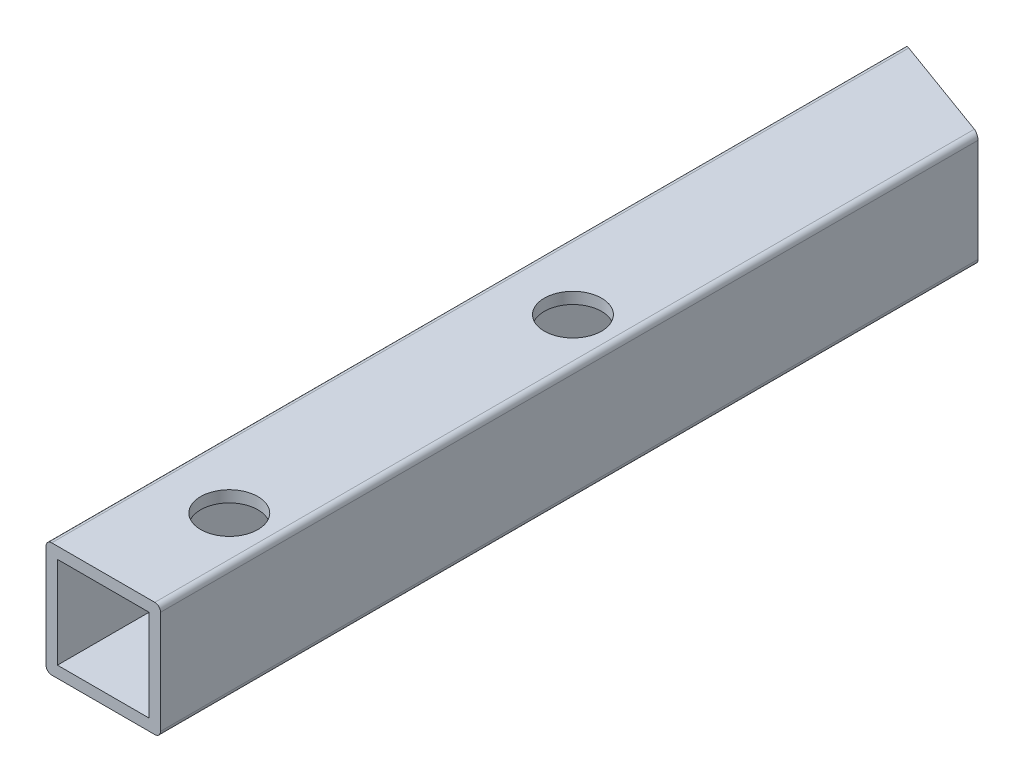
ISO-10303-21;
HEADER;
FILE_DESCRIPTION(('STEP AP214'),'2;1');
FILE_NAME('part.step','',(''),(''),'','','');
FILE_SCHEMA(('AUTOMOTIVE_DESIGN { 1 0 10303 214 1 1 1 1 }'));
ENDSEC;
DATA;
#1=APPLICATION_CONTEXT('core data for automotive mechanical design processes');
#2=APPLICATION_PROTOCOL_DEFINITION('international standard','automotive_design',2000,#1);
#3=PRODUCT_CONTEXT('',#1,'mechanical');
#4=PRODUCT('Part','Part','',(#3));
#5=PRODUCT_RELATED_PRODUCT_CATEGORY('part','',(#4));
#6=PRODUCT_DEFINITION_FORMATION('','',#4);
#7=PRODUCT_DEFINITION_CONTEXT('part definition',#1,'design');
#8=PRODUCT_DEFINITION('design','',#6,#7);
#9=PRODUCT_DEFINITION_SHAPE('','',#8);
#10=(LENGTH_UNIT() NAMED_UNIT(*) SI_UNIT(.MILLI.,.METRE.));
#11=(NAMED_UNIT(*) PLANE_ANGLE_UNIT() SI_UNIT($,.RADIAN.));
#12=(NAMED_UNIT(*) SI_UNIT($,.STERADIAN.) SOLID_ANGLE_UNIT());
#13=UNCERTAINTY_MEASURE_WITH_UNIT(LENGTH_MEASURE(1.E-05),#10,'distance_accuracy_value','');
#14=(GEOMETRIC_REPRESENTATION_CONTEXT(3) GLOBAL_UNCERTAINTY_ASSIGNED_CONTEXT((#13)) GLOBAL_UNIT_ASSIGNED_CONTEXT((#10,
#11,#12)) REPRESENTATION_CONTEXT('',''));
#15=CARTESIAN_POINT('',(0.,0.,0.));
#16=DIRECTION('',(0.,0.,1.));
#17=DIRECTION('',(1.,0.,0.));
#18=AXIS2_PLACEMENT_3D('',#15,#16,#17);
#19=CARTESIAN_POINT('',(-9.,-9.,150.));
#20=DIRECTION('',(0.,0.,-1.));
#21=DIRECTION('',(-1.,0.,0.));
#22=AXIS2_PLACEMENT_3D('',#19,#20,#21);
#23=CYLINDRICAL_SURFACE('',#22,0.999999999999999);
#24=DIRECTION('',(0.,0.,-1.));
#25=VECTOR('',#24,1.);
#26=CARTESIAN_POINT('',(-10.,-9.,150.));
#27=LINE('',#26,#25);
#28=CARTESIAN_POINT('',(-10.,-9.,150.));
#29=VERTEX_POINT('',#28);
#30=CARTESIAN_POINT('',(-10.,-9.,0.));
#31=VERTEX_POINT('',#30);
#32=EDGE_CURVE('E169',#29,#31,#27,.T.);
#33=ORIENTED_EDGE('',*,*,#32,.T.);
#34=CARTESIAN_POINT('',(-9.,-9.,0.363970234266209));
#35=DIRECTION('',(0.34202014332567,0.,-0.939692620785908));
#36=DIRECTION('',(-0.939692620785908,0.,-0.34202014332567));
#37=AXIS2_PLACEMENT_3D('',#34,#35,#36);
#38=ELLIPSE('',#37,1.06417777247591,0.999999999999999);
#39=CARTESIAN_POINT('',(-8.99999999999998,-10.,0.363970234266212));
#40=VERTEX_POINT('',#39);
#41=EDGE_CURVE('E231',#31,#40,#38,.F.);
#42=ORIENTED_EDGE('',*,*,#41,.T.);
#43=DIRECTION('',(0.,0.,-1.));
#44=VECTOR('',#43,1.);
#45=CARTESIAN_POINT('',(-9.,-10.,150.));
#46=LINE('',#45,#44);
#47=CARTESIAN_POINT('',(-9.,-10.,150.));
#48=VERTEX_POINT('',#47);
#49=EDGE_CURVE('E40',#48,#40,#46,.T.);
#50=ORIENTED_EDGE('',*,*,#49,.F.);
#51=CARTESIAN_POINT('',(-9.,-9.,150.));
#52=DIRECTION('',(0.,0.,-1.));
#53=DIRECTION('',(-1.,0.,0.));
#54=AXIS2_PLACEMENT_3D('',#51,#52,#53);
#55=CIRCLE('',#54,0.999999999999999);
#56=EDGE_CURVE('E148',#48,#29,#55,.T.);
#57=ORIENTED_EDGE('',*,*,#56,.T.);
#58=EDGE_LOOP('',(#33,#42,#50,#57));
#59=FACE_BOUND('',#58,.T.);
#60=ADVANCED_FACE('F32',(#59),#23,.T.);
#61=CARTESIAN_POINT('',(9.,-10.,150.));
#62=DIRECTION('',(0.,-1.,0.));
#63=DIRECTION('',(0.,0.,-1.));
#64=AXIS2_PLACEMENT_3D('',#61,#62,#63);
#65=PLANE('',#64);
#66=CARTESIAN_POINT('',(2.,-10.,130.));
#67=DIRECTION('',(0.,-1.,0.));
#68=DIRECTION('',(0.,0.,-1.));
#69=AXIS2_PLACEMENT_3D('',#66,#67,#68);
#70=CIRCLE('',#69,5.);
#71=CARTESIAN_POINT('',(2.,-10.,135.));
#72=VERTEX_POINT('',#71);
#73=EDGE_CURVE('E203',#72,#72,#70,.T.);
#74=ORIENTED_EDGE('',*,*,#73,.F.);
#75=EDGE_LOOP('',(#74));
#76=FACE_BOUND('',#75,.T.);
#77=CARTESIAN_POINT('',(2.,-10.,70.));
#78=DIRECTION('',(0.,-1.,0.));
#79=DIRECTION('',(0.,0.,-1.));
#80=AXIS2_PLACEMENT_3D('',#77,#78,#79);
#81=CIRCLE('',#80,5.);
#82=CARTESIAN_POINT('',(2.,-10.,75.));
#83=VERTEX_POINT('',#82);
#84=EDGE_CURVE('E200',#83,#83,#81,.T.);
#85=ORIENTED_EDGE('',*,*,#84,.F.);
#86=EDGE_LOOP('',(#85));
#87=FACE_BOUND('',#86,.T.);
#88=ORIENTED_EDGE('',*,*,#49,.T.);
#89=DIRECTION('',(0.939692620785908,0.,0.34202014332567));
#90=VECTOR('',#89,1.);
#91=CARTESIAN_POINT('',(54.9864929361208,-10.,23.6531490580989));
#92=LINE('',#91,#90);
#93=CARTESIAN_POINT('',(9.,-10.,6.91543445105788));
#94=VERTEX_POINT('',#93);
#95=EDGE_CURVE('E228',#40,#94,#92,.T.);
#96=ORIENTED_EDGE('',*,*,#95,.T.);
#97=DIRECTION('',(0.,0.,-1.));
#98=VECTOR('',#97,1.);
#99=CARTESIAN_POINT('',(9.,-10.,150.));
#100=LINE('',#99,#98);
#101=CARTESIAN_POINT('',(9.,-10.,150.));
#102=VERTEX_POINT('',#101);
#103=EDGE_CURVE('E174',#102,#94,#100,.T.);
#104=ORIENTED_EDGE('',*,*,#103,.F.);
#105=DIRECTION('',(-1.,0.,0.));
#106=VECTOR('',#105,1.);
#107=CARTESIAN_POINT('',(9.,-10.,150.));
#108=LINE('',#107,#106);
#109=EDGE_CURVE('E166',#102,#48,#108,.T.);
#110=ORIENTED_EDGE('',*,*,#109,.T.);
#111=EDGE_LOOP('',(#88,#96,#104,#110));
#112=FACE_BOUND('',#111,.T.);
#113=ADVANCED_FACE('F259',(#76,#87,#112),#65,.T.);
#114=CARTESIAN_POINT('',(9.,-9.,150.));
#115=DIRECTION('',(0.,0.,-1.));
#116=DIRECTION('',(-1.,0.,0.));
#117=AXIS2_PLACEMENT_3D('',#114,#115,#116);
#118=CYLINDRICAL_SURFACE('',#117,1.);
#119=ORIENTED_EDGE('',*,*,#103,.T.);
#120=CARTESIAN_POINT('',(9.,-9.,6.91543445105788));
#121=DIRECTION('',(0.34202014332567,0.,-0.939692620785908));
#122=DIRECTION('',(-0.939692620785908,0.,-0.34202014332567));
#123=AXIS2_PLACEMENT_3D('',#120,#121,#122);
#124=ELLIPSE('',#123,1.06417777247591,1.);
#125=CARTESIAN_POINT('',(10.,-9.,7.27940468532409));
#126=VERTEX_POINT('',#125);
#127=EDGE_CURVE('E225',#94,#126,#124,.F.);
#128=ORIENTED_EDGE('',*,*,#127,.T.);
#129=DIRECTION('',(0.,0.,-1.));
#130=VECTOR('',#129,1.);
#131=CARTESIAN_POINT('',(10.,-9.,150.));
#132=LINE('',#131,#130);
#133=CARTESIAN_POINT('',(10.,-9.,150.));
#134=VERTEX_POINT('',#133);
#135=EDGE_CURVE('E177',#134,#126,#132,.T.);
#136=ORIENTED_EDGE('',*,*,#135,.F.);
#137=CARTESIAN_POINT('',(9.,-9.,150.));
#138=DIRECTION('',(0.,0.,-1.));
#139=DIRECTION('',(-1.,0.,0.));
#140=AXIS2_PLACEMENT_3D('',#137,#138,#139);
#141=CIRCLE('',#140,1.);
#142=EDGE_CURVE('E163',#134,#102,#141,.T.);
#143=ORIENTED_EDGE('',*,*,#142,.T.);
#144=EDGE_LOOP('',(#119,#128,#136,#143));
#145=FACE_BOUND('',#144,.T.);
#146=ADVANCED_FACE('F264',(#145),#118,.T.);
#147=CARTESIAN_POINT('',(10.,-9.,150.));
#148=DIRECTION('',(-1.,0.,0.));
#149=DIRECTION('',(0.,-1.,0.));
#150=AXIS2_PLACEMENT_3D('',#147,#148,#149);
#151=PLANE('',#150);
#152=DIRECTION('',(0.,-1.,0.));
#153=VECTOR('',#152,1.);
#154=CARTESIAN_POINT('',(10.,-9.00000000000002,7.27940468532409));
#155=LINE('',#154,#153);
#156=CARTESIAN_POINT('',(10.,9.00000000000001,7.27940468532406));
#157=VERTEX_POINT('',#156);
#158=EDGE_CURVE('E223',#157,#126,#155,.T.);
#159=ORIENTED_EDGE('',*,*,#158,.F.);
#160=DIRECTION('',(0.,0.,-1.));
#161=VECTOR('',#160,1.);
#162=CARTESIAN_POINT('',(10.,9.00000000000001,150.));
#163=LINE('',#162,#161);
#164=CARTESIAN_POINT('',(10.,9.00000000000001,150.));
#165=VERTEX_POINT('',#164);
#166=EDGE_CURVE('E180',#165,#157,#163,.T.);
#167=ORIENTED_EDGE('',*,*,#166,.F.);
#168=DIRECTION('',(0.,1.,0.));
#169=VECTOR('',#168,1.);
#170=CARTESIAN_POINT('',(10.,-9.,150.));
#171=LINE('',#170,#169);
#172=EDGE_CURVE('E161',#134,#165,#171,.T.);
#173=ORIENTED_EDGE('',*,*,#172,.F.);
#174=ORIENTED_EDGE('',*,*,#135,.T.);
#175=EDGE_LOOP('',(#159,#167,#173,#174));
#176=FACE_BOUND('',#175,.T.);
#177=ADVANCED_FACE('F289',(#176),#151,.F.);
#178=CARTESIAN_POINT('',(9.,9.,150.));
#179=DIRECTION('',(0.,0.,-1.));
#180=DIRECTION('',(-1.,0.,0.));
#181=AXIS2_PLACEMENT_3D('',#178,#179,#180);
#182=CYLINDRICAL_SURFACE('',#181,0.999999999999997);
#183=CARTESIAN_POINT('',(9.,9.,6.91543445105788));
#184=DIRECTION('',(0.34202014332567,0.,-0.939692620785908));
#185=DIRECTION('',(-0.939692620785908,0.,-0.34202014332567));
#186=AXIS2_PLACEMENT_3D('',#183,#184,#185);
#187=ELLIPSE('',#186,1.06417777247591,0.999999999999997);
#188=CARTESIAN_POINT('',(9.00000000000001,10.,6.91543445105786));
#189=VERTEX_POINT('',#188);
#190=EDGE_CURVE('E221',#189,#157,#187,.T.);
#191=ORIENTED_EDGE('',*,*,#190,.F.);
#192=DIRECTION('',(0.,0.,-1.));
#193=VECTOR('',#192,1.);
#194=CARTESIAN_POINT('',(9.,10.,150.));
#195=LINE('',#194,#193);
#196=CARTESIAN_POINT('',(9.,10.,150.));
#197=VERTEX_POINT('',#196);
#198=EDGE_CURVE('E183',#197,#189,#195,.T.);
#199=ORIENTED_EDGE('',*,*,#198,.F.);
#200=CARTESIAN_POINT('',(9.,9.,150.));
#201=DIRECTION('',(0.,0.,1.));
#202=DIRECTION('',(1.,0.,0.));
#203=AXIS2_PLACEMENT_3D('',#200,#201,#202);
#204=CIRCLE('',#203,0.999999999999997);
#205=EDGE_CURVE('E159',#165,#197,#204,.T.);
#206=ORIENTED_EDGE('',*,*,#205,.F.);
#207=ORIENTED_EDGE('',*,*,#166,.T.);
#208=EDGE_LOOP('',(#191,#199,#206,#207));
#209=FACE_BOUND('',#208,.T.);
#210=ADVANCED_FACE('F286',(#209),#182,.T.);
#211=CARTESIAN_POINT('',(-9.,10.,150.));
#212=DIRECTION('',(0.,1.,0.));
#213=DIRECTION('',(0.,0.,1.));
#214=AXIS2_PLACEMENT_3D('',#211,#212,#213);
#215=PLANE('',#214);
#216=CARTESIAN_POINT('',(2.,10.,130.));
#217=DIRECTION('',(0.,1.,0.));
#218=DIRECTION('',(0.,0.,1.));
#219=AXIS2_PLACEMENT_3D('',#216,#217,#218);
#220=CIRCLE('',#219,5.);
#221=CARTESIAN_POINT('',(2.,10.,135.));
#222=VERTEX_POINT('',#221);
#223=EDGE_CURVE('E338',#222,#222,#220,.T.);
#224=ORIENTED_EDGE('',*,*,#223,.F.);
#225=EDGE_LOOP('',(#224));
#226=FACE_BOUND('',#225,.T.);
#227=CARTESIAN_POINT('',(2.,10.,70.));
#228=DIRECTION('',(0.,1.,0.));
#229=DIRECTION('',(0.,0.,1.));
#230=AXIS2_PLACEMENT_3D('',#227,#228,#229);
#231=CIRCLE('',#230,5.);
#232=CARTESIAN_POINT('',(2.,10.,75.));
#233=VERTEX_POINT('',#232);
#234=EDGE_CURVE('E196',#233,#233,#231,.T.);
#235=ORIENTED_EDGE('',*,*,#234,.F.);
#236=EDGE_LOOP('',(#235));
#237=FACE_BOUND('',#236,.T.);
#238=ORIENTED_EDGE('',*,*,#198,.T.);
#239=DIRECTION('',(-0.939692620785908,0.,-0.34202014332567));
#240=VECTOR('',#239,1.);
#241=CARTESIAN_POINT('',(39.09209294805,10.,17.86806057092));
#242=LINE('',#241,#240);
#243=CARTESIAN_POINT('',(-9.,10.,0.363970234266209));
#244=VERTEX_POINT('',#243);
#245=EDGE_CURVE('E218',#189,#244,#242,.T.);
#246=ORIENTED_EDGE('',*,*,#245,.T.);
#247=DIRECTION('',(0.,0.,-1.));
#248=VECTOR('',#247,1.);
#249=CARTESIAN_POINT('',(-9.,10.,150.));
#250=LINE('',#249,#248);
#251=CARTESIAN_POINT('',(-9.,10.,150.));
#252=VERTEX_POINT('',#251);
#253=EDGE_CURVE('E186',#252,#244,#250,.T.);
#254=ORIENTED_EDGE('',*,*,#253,.F.);
#255=DIRECTION('',(1.,0.,0.));
#256=VECTOR('',#255,1.);
#257=CARTESIAN_POINT('',(-9.,10.,150.));
#258=LINE('',#257,#256);
#259=EDGE_CURVE('E156',#252,#197,#258,.T.);
#260=ORIENTED_EDGE('',*,*,#259,.T.);
#261=EDGE_LOOP('',(#238,#246,#254,#260));
#262=FACE_BOUND('',#261,.T.);
#263=ADVANCED_FACE('F277',(#226,#237,#262),#215,.T.);
#264=CARTESIAN_POINT('',(-9.,9.,150.));
#265=DIRECTION('',(0.,0.,-1.));
#266=DIRECTION('',(-1.,0.,0.));
#267=AXIS2_PLACEMENT_3D('',#264,#265,#266);
#268=CYLINDRICAL_SURFACE('',#267,0.999999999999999);
#269=ORIENTED_EDGE('',*,*,#253,.T.);
#270=CARTESIAN_POINT('',(-9.,9.,0.363970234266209));
#271=DIRECTION('',(0.34202014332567,0.,-0.939692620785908));
#272=DIRECTION('',(-0.939692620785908,0.,-0.34202014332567));
#273=AXIS2_PLACEMENT_3D('',#270,#271,#272);
#274=ELLIPSE('',#273,1.06417777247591,0.999999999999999);
#275=CARTESIAN_POINT('',(-10.,9.,0.));
#276=VERTEX_POINT('',#275);
#277=EDGE_CURVE('E130',#244,#276,#274,.F.);
#278=ORIENTED_EDGE('',*,*,#277,.T.);
#279=DIRECTION('',(0.,0.,-1.));
#280=VECTOR('',#279,1.);
#281=CARTESIAN_POINT('',(-10.,9.,150.));
#282=LINE('',#281,#280);
#283=CARTESIAN_POINT('',(-10.,9.,150.));
#284=VERTEX_POINT('',#283);
#285=EDGE_CURVE('E189',#284,#276,#282,.T.);
#286=ORIENTED_EDGE('',*,*,#285,.F.);
#287=CARTESIAN_POINT('',(-9.,9.,150.));
#288=DIRECTION('',(0.,0.,-1.));
#289=DIRECTION('',(-1.,0.,0.));
#290=AXIS2_PLACEMENT_3D('',#287,#288,#289);
#291=CIRCLE('',#290,0.999999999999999);
#292=EDGE_CURVE('E153',#284,#252,#291,.T.);
#293=ORIENTED_EDGE('',*,*,#292,.T.);
#294=EDGE_LOOP('',(#269,#278,#286,#293));
#295=FACE_BOUND('',#294,.T.);
#296=ADVANCED_FACE('F254',(#295),#268,.T.);
#297=CARTESIAN_POINT('',(-8.,-9.,150.));
#298=DIRECTION('',(1.,0.,0.));
#299=DIRECTION('',(0.,1.,0.));
#300=AXIS2_PLACEMENT_3D('',#297,#298,#299);
#301=PLANE('',#300);
#302=DIRECTION('',(0.,0.,-1.));
#303=VECTOR('',#302,1.);
#304=CARTESIAN_POINT('',(-8.,-8.,150.));
#305=LINE('',#304,#303);
#306=CARTESIAN_POINT('',(-8.,-8.,150.));
#307=VERTEX_POINT('',#306);
#308=CARTESIAN_POINT('',(-8.,-8.,0.727940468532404));
#309=VERTEX_POINT('',#308);
#310=EDGE_CURVE('E129',#307,#309,#305,.T.);
#311=ORIENTED_EDGE('',*,*,#310,.T.);
#312=DIRECTION('',(0.,1.,0.));
#313=VECTOR('',#312,1.);
#314=CARTESIAN_POINT('',(-8.,-9.,0.727940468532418));
#315=LINE('',#314,#313);
#316=CARTESIAN_POINT('',(-7.99999999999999,8.,0.727940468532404));
#317=VERTEX_POINT('',#316);
#318=EDGE_CURVE('E121',#309,#317,#315,.T.);
#319=ORIENTED_EDGE('',*,*,#318,.T.);
#320=DIRECTION('',(0.,0.,-1.));
#321=VECTOR('',#320,1.);
#322=CARTESIAN_POINT('',(-8.,8.,150.));
#323=LINE('',#322,#321);
#324=CARTESIAN_POINT('',(-8.,8.,150.));
#325=VERTEX_POINT('',#324);
#326=EDGE_CURVE('E127',#325,#317,#323,.T.);
#327=ORIENTED_EDGE('',*,*,#326,.F.);
#328=DIRECTION('',(0.,-1.,0.));
#329=VECTOR('',#328,1.);
#330=CARTESIAN_POINT('',(-8.,-9.,150.));
#331=LINE('',#330,#329);
#332=EDGE_CURVE('E234',#325,#307,#331,.T.);
#333=ORIENTED_EDGE('',*,*,#332,.T.);
#334=EDGE_LOOP('',(#311,#319,#327,#333));
#335=FACE_BOUND('',#334,.T.);
#336=ADVANCED_FACE('F126',(#335),#301,.T.);
#337=CARTESIAN_POINT('',(-9.,-8.,150.));
#338=DIRECTION('',(0.,-1.,0.));
#339=DIRECTION('',(0.,0.,-1.));
#340=AXIS2_PLACEMENT_3D('',#337,#338,#339);
#341=PLANE('',#340);
#342=CARTESIAN_POINT('',(2.,-8.,130.));
#343=DIRECTION('',(0.,-1.,0.));
#344=DIRECTION('',(0.,0.,-1.));
#345=AXIS2_PLACEMENT_3D('',#342,#343,#344);
#346=CIRCLE('',#345,5.);
#347=CARTESIAN_POINT('',(2.,-8.,135.));
#348=VERTEX_POINT('',#347);
#349=EDGE_CURVE('E208',#348,#348,#346,.T.);
#350=ORIENTED_EDGE('',*,*,#349,.T.);
#351=EDGE_LOOP('',(#350));
#352=FACE_BOUND('',#351,.T.);
#353=CARTESIAN_POINT('',(2.,-8.,70.));
#354=DIRECTION('',(0.,-1.,0.));
#355=DIRECTION('',(0.,0.,-1.));
#356=AXIS2_PLACEMENT_3D('',#353,#354,#355);
#357=CIRCLE('',#356,5.);
#358=CARTESIAN_POINT('',(2.,-8.,75.));
#359=VERTEX_POINT('',#358);
#360=EDGE_CURVE('E195',#359,#359,#357,.T.);
#361=ORIENTED_EDGE('',*,*,#360,.T.);
#362=EDGE_LOOP('',(#361));
#363=FACE_BOUND('',#362,.T.);
#364=DIRECTION('',(0.939692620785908,0.,0.34202014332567));
#365=VECTOR('',#364,1.);
#366=CARTESIAN_POINT('',(39.09209294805,-8.,17.86806057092));
#367=LINE('',#366,#365);
#368=CARTESIAN_POINT('',(8.,-8.,6.5514642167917));
#369=VERTEX_POINT('',#368);
#370=EDGE_CURVE('E131',#309,#369,#367,.T.);
#371=ORIENTED_EDGE('',*,*,#370,.F.);
#372=ORIENTED_EDGE('',*,*,#310,.F.);
#373=DIRECTION('',(-1.,0.,0.));
#374=VECTOR('',#373,1.);
#375=CARTESIAN_POINT('',(-9.,-8.,150.));
#376=LINE('',#375,#374);
#377=CARTESIAN_POINT('',(8.,-8.,150.));
#378=VERTEX_POINT('',#377);
#379=EDGE_CURVE('E236',#378,#307,#376,.T.);
#380=ORIENTED_EDGE('',*,*,#379,.F.);
#381=DIRECTION('',(0.,0.,-1.));
#382=VECTOR('',#381,1.);
#383=CARTESIAN_POINT('',(8.,-8.,150.));
#384=LINE('',#383,#382);
#385=EDGE_CURVE('E138',#378,#369,#384,.T.);
#386=ORIENTED_EDGE('',*,*,#385,.T.);
#387=EDGE_LOOP('',(#371,#372,#380,#386));
#388=FACE_BOUND('',#387,.T.);
#389=ADVANCED_FACE('F245',(#352,#363,#388),#341,.F.);
#390=CARTESIAN_POINT('',(8.,-9.,150.));
#391=DIRECTION('',(-1.,0.,0.));
#392=DIRECTION('',(0.,-1.,0.));
#393=AXIS2_PLACEMENT_3D('',#390,#391,#392);
#394=PLANE('',#393);
#395=DIRECTION('',(0.,0.,-1.));
#396=VECTOR('',#395,1.);
#397=CARTESIAN_POINT('',(8.,8.,150.));
#398=LINE('',#397,#396);
#399=CARTESIAN_POINT('',(8.,8.,150.));
#400=VERTEX_POINT('',#399);
#401=CARTESIAN_POINT('',(8.,8.,6.55146421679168));
#402=VERTEX_POINT('',#401);
#403=EDGE_CURVE('E54',#400,#402,#398,.T.);
#404=ORIENTED_EDGE('',*,*,#403,.T.);
#405=DIRECTION('',(0.,-1.,0.));
#406=VECTOR('',#405,1.);
#407=CARTESIAN_POINT('',(8.,-9.00000000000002,6.5514642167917));
#408=LINE('',#407,#406);
#409=EDGE_CURVE('E47',#402,#369,#408,.T.);
#410=ORIENTED_EDGE('',*,*,#409,.T.);
#411=ORIENTED_EDGE('',*,*,#385,.F.);
#412=DIRECTION('',(0.,1.,0.));
#413=VECTOR('',#412,1.);
#414=CARTESIAN_POINT('',(8.,-9.,150.));
#415=LINE('',#414,#413);
#416=EDGE_CURVE('E140',#378,#400,#415,.T.);
#417=ORIENTED_EDGE('',*,*,#416,.T.);
#418=EDGE_LOOP('',(#404,#410,#411,#417));
#419=FACE_BOUND('',#418,.T.);
#420=ADVANCED_FACE('F240',(#419),#394,.T.);
#421=CARTESIAN_POINT('',(-9.,8.,150.));
#422=DIRECTION('',(0.,1.,0.));
#423=DIRECTION('',(0.,0.,1.));
#424=AXIS2_PLACEMENT_3D('',#421,#422,#423);
#425=PLANE('',#424);
#426=CARTESIAN_POINT('',(2.,8.,130.));
#427=DIRECTION('',(0.,1.,0.));
#428=DIRECTION('',(0.,0.,1.));
#429=AXIS2_PLACEMENT_3D('',#426,#427,#428);
#430=CIRCLE('',#429,5.);
#431=CARTESIAN_POINT('',(2.,8.,135.));
#432=VERTEX_POINT('',#431);
#433=EDGE_CURVE('E35',#432,#432,#430,.T.);
#434=ORIENTED_EDGE('',*,*,#433,.T.);
#435=EDGE_LOOP('',(#434));
#436=FACE_BOUND('',#435,.T.);
#437=CARTESIAN_POINT('',(2.,8.,70.));
#438=DIRECTION('',(0.,1.,0.));
#439=DIRECTION('',(0.,0.,1.));
#440=AXIS2_PLACEMENT_3D('',#437,#438,#439);
#441=CIRCLE('',#440,5.);
#442=CARTESIAN_POINT('',(2.,8.,75.));
#443=VERTEX_POINT('',#442);
#444=EDGE_CURVE('E193',#443,#443,#441,.T.);
#445=ORIENTED_EDGE('',*,*,#444,.T.);
#446=EDGE_LOOP('',(#445));
#447=FACE_BOUND('',#446,.T.);
#448=DIRECTION('',(-0.939692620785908,0.,-0.34202014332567));
#449=VECTOR('',#448,1.);
#450=CARTESIAN_POINT('',(39.09209294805,8.,17.86806057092));
#451=LINE('',#450,#449);
#452=EDGE_CURVE('E11',#402,#317,#451,.T.);
#453=ORIENTED_EDGE('',*,*,#452,.F.);
#454=ORIENTED_EDGE('',*,*,#403,.F.);
#455=DIRECTION('',(1.,0.,0.));
#456=VECTOR('',#455,1.);
#457=CARTESIAN_POINT('',(-9.,8.,150.));
#458=LINE('',#457,#456);
#459=EDGE_CURVE('E135',#325,#400,#458,.T.);
#460=ORIENTED_EDGE('',*,*,#459,.F.);
#461=ORIENTED_EDGE('',*,*,#326,.T.);
#462=EDGE_LOOP('',(#453,#454,#460,#461));
#463=FACE_BOUND('',#462,.T.);
#464=ADVANCED_FACE('F133',(#436,#447,#463),#425,.F.);
#465=CARTESIAN_POINT('',(-9.,-9.,150.));
#466=DIRECTION('',(0.,0.,-1.));
#467=DIRECTION('',(-1.,0.,0.));
#468=AXIS2_PLACEMENT_3D('',#465,#466,#467);
#469=PLANE('',#468);
#470=ORIENTED_EDGE('',*,*,#56,.F.);
#471=ORIENTED_EDGE('',*,*,#109,.F.);
#472=ORIENTED_EDGE('',*,*,#142,.F.);
#473=ORIENTED_EDGE('',*,*,#172,.T.);
#474=ORIENTED_EDGE('',*,*,#205,.T.);
#475=ORIENTED_EDGE('',*,*,#259,.F.);
#476=ORIENTED_EDGE('',*,*,#292,.F.);
#477=DIRECTION('',(0.,-1.,0.));
#478=VECTOR('',#477,1.);
#479=CARTESIAN_POINT('',(-10.,9.,150.));
#480=LINE('',#479,#478);
#481=EDGE_CURVE('E151',#284,#29,#480,.T.);
#482=ORIENTED_EDGE('',*,*,#481,.T.);
#483=EDGE_LOOP('',(#470,#471,#472,#473,#474,#475,#476,#482));
#484=FACE_BOUND('',#483,.T.);
#485=ORIENTED_EDGE('',*,*,#332,.F.);
#486=ORIENTED_EDGE('',*,*,#459,.T.);
#487=ORIENTED_EDGE('',*,*,#416,.F.);
#488=ORIENTED_EDGE('',*,*,#379,.T.);
#489=EDGE_LOOP('',(#485,#486,#487,#488));
#490=FACE_BOUND('',#489,.T.);
#491=ADVANCED_FACE('F243',(#484,#490),#469,.F.);
#492=CARTESIAN_POINT('',(-10.,9.,150.));
#493=DIRECTION('',(1.,0.,0.));
#494=DIRECTION('',(0.,1.,0.));
#495=AXIS2_PLACEMENT_3D('',#492,#493,#494);
#496=PLANE('',#495);
#497=DIRECTION('',(0.,-1.,0.));
#498=VECTOR('',#497,1.);
#499=CARTESIAN_POINT('',(-10.,9.,0.));
#500=LINE('',#499,#498);
#501=EDGE_CURVE('E147',#276,#31,#500,.T.);
#502=ORIENTED_EDGE('',*,*,#501,.T.);
#503=ORIENTED_EDGE('',*,*,#32,.F.);
#504=ORIENTED_EDGE('',*,*,#481,.F.);
#505=ORIENTED_EDGE('',*,*,#285,.T.);
#506=EDGE_LOOP('',(#502,#503,#504,#505));
#507=FACE_BOUND('',#506,.T.);
#508=ADVANCED_FACE('F271',(#507),#496,.F.);
#509=CARTESIAN_POINT('',(48.633931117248,33.,21.3410056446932));
#510=DIRECTION('',(0.34202014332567,0.,-0.939692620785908));
#511=DIRECTION('',(-0.939692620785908,0.,-0.34202014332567));
#512=AXIS2_PLACEMENT_3D('',#509,#510,#511);
#513=PLANE('',#512);
#514=ORIENTED_EDGE('',*,*,#501,.F.);
#515=ORIENTED_EDGE('',*,*,#277,.F.);
#516=ORIENTED_EDGE('',*,*,#245,.F.);
#517=ORIENTED_EDGE('',*,*,#190,.T.);
#518=ORIENTED_EDGE('',*,*,#158,.T.);
#519=ORIENTED_EDGE('',*,*,#127,.F.);
#520=ORIENTED_EDGE('',*,*,#95,.F.);
#521=ORIENTED_EDGE('',*,*,#41,.F.);
#522=EDGE_LOOP('',(#514,#515,#516,#517,#518,#519,#520,#521));
#523=FACE_BOUND('',#522,.T.);
#524=ORIENTED_EDGE('',*,*,#370,.T.);
#525=ORIENTED_EDGE('',*,*,#409,.F.);
#526=ORIENTED_EDGE('',*,*,#452,.T.);
#527=ORIENTED_EDGE('',*,*,#318,.F.);
#528=EDGE_LOOP('',(#524,#525,#526,#527));
#529=FACE_BOUND('',#528,.T.);
#530=ADVANCED_FACE('F120',(#523,#529),#513,.T.);
#531=CARTESIAN_POINT('',(2.,-11.,70.));
#532=DIRECTION('',(0.,1.,0.));
#533=DIRECTION('',(0.,0.,1.));
#534=AXIS2_PLACEMENT_3D('',#531,#532,#533);
#535=CYLINDRICAL_SURFACE('',#534,5.);
#536=CARTESIAN_POINT('',(2.,10.,75.));
#537=CARTESIAN_POINT('',(2.,9.97916666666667,75.));
#538=CARTESIAN_POINT('',(2.,9.95833333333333,75.));
#539=CARTESIAN_POINT('',(2.,9.91666666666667,75.));
#540=CARTESIAN_POINT('',(2.,9.89583333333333,75.));
#541=CARTESIAN_POINT('',(2.,9.85416666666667,75.));
#542=CARTESIAN_POINT('',(2.,9.83333333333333,75.));
#543=CARTESIAN_POINT('',(2.,9.79166666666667,75.));
#544=CARTESIAN_POINT('',(2.,9.77083333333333,75.));
#545=CARTESIAN_POINT('',(2.,9.72916666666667,75.));
#546=CARTESIAN_POINT('',(2.,9.70833333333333,75.));
#547=CARTESIAN_POINT('',(2.,9.66666666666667,75.));
#548=CARTESIAN_POINT('',(2.,9.64583333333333,75.));
#549=CARTESIAN_POINT('',(2.,9.60416666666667,75.));
#550=CARTESIAN_POINT('',(2.,9.58333333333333,75.));
#551=CARTESIAN_POINT('',(2.,9.54166666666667,75.));
#552=CARTESIAN_POINT('',(2.,9.52083333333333,75.));
#553=CARTESIAN_POINT('',(2.,9.47916666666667,75.));
#554=CARTESIAN_POINT('',(2.,9.45833333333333,75.));
#555=CARTESIAN_POINT('',(2.,9.41666666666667,75.));
#556=CARTESIAN_POINT('',(2.,9.39583333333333,75.));
#557=CARTESIAN_POINT('',(2.,9.35416666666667,75.));
#558=CARTESIAN_POINT('',(2.,9.33333333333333,75.));
#559=CARTESIAN_POINT('',(2.,9.29166666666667,75.));
#560=CARTESIAN_POINT('',(2.,9.27083333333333,75.));
#561=CARTESIAN_POINT('',(2.,9.22916666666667,75.));
#562=CARTESIAN_POINT('',(2.,9.20833333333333,75.));
#563=CARTESIAN_POINT('',(2.,9.16666666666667,75.));
#564=CARTESIAN_POINT('',(2.,9.14583333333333,75.));
#565=CARTESIAN_POINT('',(2.,9.10416666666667,75.));
#566=CARTESIAN_POINT('',(2.,9.08333333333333,75.));
#567=CARTESIAN_POINT('',(2.,9.04166666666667,75.));
#568=CARTESIAN_POINT('',(2.,9.02083333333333,75.));
#569=CARTESIAN_POINT('',(2.,8.97916666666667,75.));
#570=CARTESIAN_POINT('',(2.,8.95833333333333,75.));
#571=CARTESIAN_POINT('',(2.,8.91666666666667,75.));
#572=CARTESIAN_POINT('',(2.,8.89583333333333,75.));
#573=CARTESIAN_POINT('',(2.,8.85416666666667,75.));
#574=CARTESIAN_POINT('',(2.,8.83333333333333,75.));
#575=CARTESIAN_POINT('',(2.,8.79166666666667,75.));
#576=CARTESIAN_POINT('',(2.,8.77083333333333,75.));
#577=CARTESIAN_POINT('',(2.,8.72916666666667,75.));
#578=CARTESIAN_POINT('',(2.,8.70833333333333,75.));
#579=CARTESIAN_POINT('',(2.,8.66666666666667,75.));
#580=CARTESIAN_POINT('',(2.,8.64583333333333,75.));
#581=CARTESIAN_POINT('',(2.,8.60416666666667,75.));
#582=CARTESIAN_POINT('',(2.,8.58333333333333,75.));
#583=CARTESIAN_POINT('',(2.,8.54166666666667,75.));
#584=CARTESIAN_POINT('',(2.,8.52083333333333,75.));
#585=CARTESIAN_POINT('',(2.,8.47916666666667,75.));
#586=CARTESIAN_POINT('',(2.,8.45833333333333,75.));
#587=CARTESIAN_POINT('',(2.,8.41666666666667,75.));
#588=CARTESIAN_POINT('',(2.,8.39583333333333,75.));
#589=CARTESIAN_POINT('',(2.,8.35416666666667,75.));
#590=CARTESIAN_POINT('',(2.,8.33333333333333,75.));
#591=CARTESIAN_POINT('',(2.,8.29166666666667,75.));
#592=CARTESIAN_POINT('',(2.,8.27083333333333,75.));
#593=CARTESIAN_POINT('',(2.,8.22916666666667,75.));
#594=CARTESIAN_POINT('',(2.,8.20833333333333,75.));
#595=CARTESIAN_POINT('',(2.,8.16666666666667,75.));
#596=CARTESIAN_POINT('',(2.,8.14583333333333,75.));
#597=CARTESIAN_POINT('',(2.,8.10416666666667,75.));
#598=CARTESIAN_POINT('',(2.,8.08333333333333,75.));
#599=CARTESIAN_POINT('',(2.,8.04166666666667,75.));
#600=CARTESIAN_POINT('',(2.,8.02083333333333,75.));
#601=CARTESIAN_POINT('',(2.,8.,75.));
#602=B_SPLINE_CURVE_WITH_KNOTS('',3,(#536,#537,#538,#539,#540,#541,#542,#543,#544,#545,#546,
#547,#548,#549,#550,#551,#552,#553,#554,#555,#556,#557,#558,#559,#560,#561,#562,#563,#564,#565,
#566,#567,#568,#569,#570,#571,#572,#573,#574,#575,#576,#577,#578,#579,#580,#581,#582,#583,#584,
#585,#586,#587,#588,#589,#590,#591,#592,#593,#594,#595,#596,#597,#598,#599,#600,#601),
.UNSPECIFIED.,.F.,.F.,(4,2,2,2,2,2,2,2,2,2,2,2,2,2,2,2,2,2,2,2,2,2,2,2,2,2,2,2,2,2,2,2,4),(0.,
0.0625000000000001,0.125,0.1875,0.25,0.3125,0.375,0.4375,0.5,0.5625,0.625000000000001,
0.687500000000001,0.750000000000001,0.812500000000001,0.875000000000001,0.937500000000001,1.,
1.0625,1.125,1.1875,1.25,1.3125,1.375,1.4375,1.5,1.5625,1.625,1.6875,1.75,1.8125,1.875,1.9375,
2.),.UNSPECIFIED.);
#603=EDGE_CURVE('BSEAM312',#233,#443,#602,.T.);
#604=ORIENTED_EDGE('',*,*,#234,.T.);
#605=ORIENTED_EDGE('',*,*,#444,.F.);
#606=ORIENTED_EDGE('',*,*,#603,.T.);
#607=ORIENTED_EDGE('',*,*,#603,.F.);
#608=EDGE_LOOP('',(#604,#606,#605,#607));
#609=FACE_BOUND('',#608,.T.);
#610=ADVANCED_FACE('F312',(#609),#535,.F.);
#611=CARTESIAN_POINT('',(2.,-10.,75.));
#612=CARTESIAN_POINT('',(2.,-9.97916666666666,75.));
#613=CARTESIAN_POINT('',(2.,-9.95833333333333,75.));
#614=CARTESIAN_POINT('',(2.,-9.91666666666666,75.));
#615=CARTESIAN_POINT('',(2.,-9.89583333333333,75.));
#616=CARTESIAN_POINT('',(2.,-9.85416666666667,75.));
#617=CARTESIAN_POINT('',(2.,-9.83333333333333,75.));
#618=CARTESIAN_POINT('',(2.,-9.79166666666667,75.));
#619=CARTESIAN_POINT('',(2.,-9.77083333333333,75.));
#620=CARTESIAN_POINT('',(2.,-9.72916666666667,75.));
#621=CARTESIAN_POINT('',(2.,-9.70833333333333,75.));
#622=CARTESIAN_POINT('',(2.,-9.66666666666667,75.));
#623=CARTESIAN_POINT('',(2.,-9.64583333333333,75.));
#624=CARTESIAN_POINT('',(2.,-9.60416666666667,75.));
#625=CARTESIAN_POINT('',(2.,-9.58333333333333,75.));
#626=CARTESIAN_POINT('',(2.,-9.54166666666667,75.));
#627=CARTESIAN_POINT('',(2.,-9.52083333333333,75.));
#628=CARTESIAN_POINT('',(2.,-9.47916666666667,75.));
#629=CARTESIAN_POINT('',(2.,-9.45833333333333,75.));
#630=CARTESIAN_POINT('',(2.,-9.41666666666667,75.));
#631=CARTESIAN_POINT('',(2.,-9.39583333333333,75.));
#632=CARTESIAN_POINT('',(2.,-9.35416666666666,75.));
#633=CARTESIAN_POINT('',(2.,-9.33333333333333,75.));
#634=CARTESIAN_POINT('',(2.,-9.29166666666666,75.));
#635=CARTESIAN_POINT('',(2.,-9.27083333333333,75.));
#636=CARTESIAN_POINT('',(2.,-9.22916666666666,75.));
#637=CARTESIAN_POINT('',(2.,-9.20833333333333,75.));
#638=CARTESIAN_POINT('',(2.,-9.16666666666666,75.));
#639=CARTESIAN_POINT('',(2.,-9.14583333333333,75.));
#640=CARTESIAN_POINT('',(2.,-9.10416666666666,75.));
#641=CARTESIAN_POINT('',(2.,-9.08333333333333,75.));
#642=CARTESIAN_POINT('',(2.,-9.04166666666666,75.));
#643=CARTESIAN_POINT('',(2.,-9.02083333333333,75.));
#644=CARTESIAN_POINT('',(2.,-8.97916666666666,75.));
#645=CARTESIAN_POINT('',(2.,-8.95833333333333,75.));
#646=CARTESIAN_POINT('',(2.,-8.91666666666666,75.));
#647=CARTESIAN_POINT('',(2.,-8.89583333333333,75.));
#648=CARTESIAN_POINT('',(2.,-8.85416666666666,75.));
#649=CARTESIAN_POINT('',(2.,-8.83333333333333,75.));
#650=CARTESIAN_POINT('',(2.,-8.79166666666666,75.));
#651=CARTESIAN_POINT('',(2.,-8.77083333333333,75.));
#652=CARTESIAN_POINT('',(2.,-8.72916666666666,75.));
#653=CARTESIAN_POINT('',(2.,-8.70833333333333,75.));
#654=CARTESIAN_POINT('',(2.,-8.66666666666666,75.));
#655=CARTESIAN_POINT('',(2.,-8.64583333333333,75.));
#656=CARTESIAN_POINT('',(2.,-8.60416666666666,75.));
#657=CARTESIAN_POINT('',(2.,-8.58333333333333,75.));
#658=CARTESIAN_POINT('',(2.,-8.54166666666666,75.));
#659=CARTESIAN_POINT('',(2.,-8.52083333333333,75.));
#660=CARTESIAN_POINT('',(2.,-8.47916666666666,75.));
#661=CARTESIAN_POINT('',(2.,-8.45833333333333,75.));
#662=CARTESIAN_POINT('',(2.,-8.41666666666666,75.));
#663=CARTESIAN_POINT('',(2.,-8.39583333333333,75.));
#664=CARTESIAN_POINT('',(2.,-8.35416666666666,75.));
#665=CARTESIAN_POINT('',(2.,-8.33333333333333,75.));
#666=CARTESIAN_POINT('',(2.,-8.29166666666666,75.));
#667=CARTESIAN_POINT('',(2.,-8.27083333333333,75.));
#668=CARTESIAN_POINT('',(2.,-8.22916666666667,75.));
#669=CARTESIAN_POINT('',(2.,-8.20833333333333,75.));
#670=CARTESIAN_POINT('',(2.,-8.16666666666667,75.));
#671=CARTESIAN_POINT('',(2.,-8.14583333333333,75.));
#672=CARTESIAN_POINT('',(2.,-8.10416666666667,75.));
#673=CARTESIAN_POINT('',(2.,-8.08333333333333,75.));
#674=CARTESIAN_POINT('',(2.,-8.04166666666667,75.));
#675=CARTESIAN_POINT('',(2.,-8.02083333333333,75.));
#676=CARTESIAN_POINT('',(2.,-8.,75.));
#677=B_SPLINE_CURVE_WITH_KNOTS('',3,(#611,#612,#613,#614,#615,#616,#617,#618,#619,#620,#621,
#622,#623,#624,#625,#626,#627,#628,#629,#630,#631,#632,#633,#634,#635,#636,#637,#638,#639,#640,
#641,#642,#643,#644,#645,#646,#647,#648,#649,#650,#651,#652,#653,#654,#655,#656,#657,#658,#659,
#660,#661,#662,#663,#664,#665,#666,#667,#668,#669,#670,#671,#672,#673,#674,#675,#676),
.UNSPECIFIED.,.F.,.F.,(4,2,2,2,2,2,2,2,2,2,2,2,2,2,2,2,2,2,2,2,2,2,2,2,2,2,2,2,2,2,2,2,4),(0.,
0.0625000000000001,0.124999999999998,0.187499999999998,0.249999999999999,0.312499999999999,
0.374999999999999,0.437499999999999,0.499999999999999,0.562499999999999,0.624999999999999,
0.687499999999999,0.749999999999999,0.812499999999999,0.874999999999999,0.937499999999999,
0.999999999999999,1.0625,1.125,1.1875,1.25,1.3125,1.375,1.4375,1.5,1.5625,1.625,1.6875,1.75,
1.8125,1.875,1.9375,2.),.UNSPECIFIED.);
#678=EDGE_CURVE('BSEAM323',#83,#359,#677,.T.);
#679=ORIENTED_EDGE('',*,*,#84,.T.);
#680=ORIENTED_EDGE('',*,*,#360,.F.);
#681=ORIENTED_EDGE('',*,*,#678,.T.);
#682=ORIENTED_EDGE('',*,*,#678,.F.);
#683=EDGE_LOOP('',(#679,#681,#680,#682));
#684=FACE_BOUND('',#683,.T.);
#685=ADVANCED_FACE('F323',(#684),#535,.F.);
#686=CARTESIAN_POINT('',(2.,-11.,130.));
#687=DIRECTION('',(0.,1.,0.));
#688=DIRECTION('',(0.,0.,1.));
#689=AXIS2_PLACEMENT_3D('',#686,#687,#688);
#690=CYLINDRICAL_SURFACE('',#689,5.);
#691=CARTESIAN_POINT('',(2.,10.,135.));
#692=CARTESIAN_POINT('',(2.,9.97916666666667,135.));
#693=CARTESIAN_POINT('',(2.,9.95833333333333,135.));
#694=CARTESIAN_POINT('',(2.,9.91666666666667,135.));
#695=CARTESIAN_POINT('',(2.,9.89583333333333,135.));
#696=CARTESIAN_POINT('',(2.,9.85416666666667,135.));
#697=CARTESIAN_POINT('',(2.,9.83333333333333,135.));
#698=CARTESIAN_POINT('',(2.,9.79166666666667,135.));
#699=CARTESIAN_POINT('',(2.,9.77083333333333,135.));
#700=CARTESIAN_POINT('',(2.,9.72916666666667,135.));
#701=CARTESIAN_POINT('',(2.,9.70833333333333,135.));
#702=CARTESIAN_POINT('',(2.,9.66666666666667,135.));
#703=CARTESIAN_POINT('',(2.,9.64583333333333,135.));
#704=CARTESIAN_POINT('',(2.,9.60416666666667,135.));
#705=CARTESIAN_POINT('',(2.,9.58333333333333,135.));
#706=CARTESIAN_POINT('',(2.,9.54166666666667,135.));
#707=CARTESIAN_POINT('',(2.,9.52083333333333,135.));
#708=CARTESIAN_POINT('',(2.,9.47916666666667,135.));
#709=CARTESIAN_POINT('',(2.,9.45833333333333,135.));
#710=CARTESIAN_POINT('',(2.,9.41666666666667,135.));
#711=CARTESIAN_POINT('',(2.,9.39583333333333,135.));
#712=CARTESIAN_POINT('',(2.,9.35416666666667,135.));
#713=CARTESIAN_POINT('',(2.,9.33333333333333,135.));
#714=CARTESIAN_POINT('',(2.,9.29166666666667,135.));
#715=CARTESIAN_POINT('',(2.,9.27083333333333,135.));
#716=CARTESIAN_POINT('',(2.,9.22916666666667,135.));
#717=CARTESIAN_POINT('',(2.,9.20833333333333,135.));
#718=CARTESIAN_POINT('',(2.,9.16666666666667,135.));
#719=CARTESIAN_POINT('',(2.,9.14583333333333,135.));
#720=CARTESIAN_POINT('',(2.,9.10416666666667,135.));
#721=CARTESIAN_POINT('',(2.,9.08333333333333,135.));
#722=CARTESIAN_POINT('',(2.,9.04166666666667,135.));
#723=CARTESIAN_POINT('',(2.,9.02083333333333,135.));
#724=CARTESIAN_POINT('',(2.,8.97916666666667,135.));
#725=CARTESIAN_POINT('',(2.,8.95833333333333,135.));
#726=CARTESIAN_POINT('',(2.,8.91666666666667,135.));
#727=CARTESIAN_POINT('',(2.,8.89583333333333,135.));
#728=CARTESIAN_POINT('',(2.,8.85416666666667,135.));
#729=CARTESIAN_POINT('',(2.,8.83333333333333,135.));
#730=CARTESIAN_POINT('',(2.,8.79166666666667,135.));
#731=CARTESIAN_POINT('',(2.,8.77083333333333,135.));
#732=CARTESIAN_POINT('',(2.,8.72916666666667,135.));
#733=CARTESIAN_POINT('',(2.,8.70833333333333,135.));
#734=CARTESIAN_POINT('',(2.,8.66666666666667,135.));
#735=CARTESIAN_POINT('',(2.,8.64583333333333,135.));
#736=CARTESIAN_POINT('',(2.,8.60416666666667,135.));
#737=CARTESIAN_POINT('',(2.,8.58333333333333,135.));
#738=CARTESIAN_POINT('',(2.,8.54166666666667,135.));
#739=CARTESIAN_POINT('',(2.,8.52083333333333,135.));
#740=CARTESIAN_POINT('',(2.,8.47916666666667,135.));
#741=CARTESIAN_POINT('',(2.,8.45833333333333,135.));
#742=CARTESIAN_POINT('',(2.,8.41666666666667,135.));
#743=CARTESIAN_POINT('',(2.,8.39583333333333,135.));
#744=CARTESIAN_POINT('',(2.,8.35416666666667,135.));
#745=CARTESIAN_POINT('',(2.,8.33333333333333,135.));
#746=CARTESIAN_POINT('',(2.,8.29166666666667,135.));
#747=CARTESIAN_POINT('',(2.,8.27083333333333,135.));
#748=CARTESIAN_POINT('',(2.,8.22916666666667,135.));
#749=CARTESIAN_POINT('',(2.,8.20833333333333,135.));
#750=CARTESIAN_POINT('',(2.,8.16666666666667,135.));
#751=CARTESIAN_POINT('',(2.,8.14583333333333,135.));
#752=CARTESIAN_POINT('',(2.,8.10416666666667,135.));
#753=CARTESIAN_POINT('',(2.,8.08333333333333,135.));
#754=CARTESIAN_POINT('',(2.,8.04166666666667,135.));
#755=CARTESIAN_POINT('',(2.,8.02083333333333,135.));
#756=CARTESIAN_POINT('',(2.,8.,135.));
#757=B_SPLINE_CURVE_WITH_KNOTS('',3,(#691,#692,#693,#694,#695,#696,#697,#698,#699,#700,#701,
#702,#703,#704,#705,#706,#707,#708,#709,#710,#711,#712,#713,#714,#715,#716,#717,#718,#719,#720,
#721,#722,#723,#724,#725,#726,#727,#728,#729,#730,#731,#732,#733,#734,#735,#736,#737,#738,#739,
#740,#741,#742,#743,#744,#745,#746,#747,#748,#749,#750,#751,#752,#753,#754,#755,#756),
.UNSPECIFIED.,.F.,.F.,(4,2,2,2,2,2,2,2,2,2,2,2,2,2,2,2,2,2,2,2,2,2,2,2,2,2,2,2,2,2,2,2,4),(0.,
0.0625000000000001,0.125,0.1875,0.25,0.3125,0.375,0.4375,0.5,0.5625,0.625000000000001,
0.687500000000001,0.750000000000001,0.812500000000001,0.875000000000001,0.937500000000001,1.,
1.0625,1.125,1.1875,1.25,1.3125,1.375,1.4375,1.5,1.5625,1.625,1.6875,1.75,1.8125,1.875,1.9375,
2.),.UNSPECIFIED.);
#758=EDGE_CURVE('BSEAM326',#222,#432,#757,.T.);
#759=ORIENTED_EDGE('',*,*,#223,.T.);
#760=ORIENTED_EDGE('',*,*,#433,.F.);
#761=ORIENTED_EDGE('',*,*,#758,.T.);
#762=ORIENTED_EDGE('',*,*,#758,.F.);
#763=EDGE_LOOP('',(#759,#761,#760,#762));
#764=FACE_BOUND('',#763,.T.);
#765=ADVANCED_FACE('F326',(#764),#690,.F.);
#766=CARTESIAN_POINT('',(2.,-10.,135.));
#767=CARTESIAN_POINT('',(2.,-9.97916666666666,135.));
#768=CARTESIAN_POINT('',(2.,-9.95833333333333,135.));
#769=CARTESIAN_POINT('',(2.,-9.91666666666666,135.));
#770=CARTESIAN_POINT('',(2.,-9.89583333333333,135.));
#771=CARTESIAN_POINT('',(2.,-9.85416666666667,135.));
#772=CARTESIAN_POINT('',(2.,-9.83333333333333,135.));
#773=CARTESIAN_POINT('',(2.,-9.79166666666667,135.));
#774=CARTESIAN_POINT('',(2.,-9.77083333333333,135.));
#775=CARTESIAN_POINT('',(2.,-9.72916666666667,135.));
#776=CARTESIAN_POINT('',(2.,-9.70833333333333,135.));
#777=CARTESIAN_POINT('',(2.,-9.66666666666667,135.));
#778=CARTESIAN_POINT('',(2.,-9.64583333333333,135.));
#779=CARTESIAN_POINT('',(2.,-9.60416666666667,135.));
#780=CARTESIAN_POINT('',(2.,-9.58333333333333,135.));
#781=CARTESIAN_POINT('',(2.,-9.54166666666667,135.));
#782=CARTESIAN_POINT('',(2.,-9.52083333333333,135.));
#783=CARTESIAN_POINT('',(2.,-9.47916666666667,135.));
#784=CARTESIAN_POINT('',(2.,-9.45833333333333,135.));
#785=CARTESIAN_POINT('',(2.,-9.41666666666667,135.));
#786=CARTESIAN_POINT('',(2.,-9.39583333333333,135.));
#787=CARTESIAN_POINT('',(2.,-9.35416666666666,135.));
#788=CARTESIAN_POINT('',(2.,-9.33333333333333,135.));
#789=CARTESIAN_POINT('',(2.,-9.29166666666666,135.));
#790=CARTESIAN_POINT('',(2.,-9.27083333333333,135.));
#791=CARTESIAN_POINT('',(2.,-9.22916666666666,135.));
#792=CARTESIAN_POINT('',(2.,-9.20833333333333,135.));
#793=CARTESIAN_POINT('',(2.,-9.16666666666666,135.));
#794=CARTESIAN_POINT('',(2.,-9.14583333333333,135.));
#795=CARTESIAN_POINT('',(2.,-9.10416666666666,135.));
#796=CARTESIAN_POINT('',(2.,-9.08333333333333,135.));
#797=CARTESIAN_POINT('',(2.,-9.04166666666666,135.));
#798=CARTESIAN_POINT('',(2.,-9.02083333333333,135.));
#799=CARTESIAN_POINT('',(2.,-8.97916666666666,135.));
#800=CARTESIAN_POINT('',(2.,-8.95833333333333,135.));
#801=CARTESIAN_POINT('',(2.,-8.91666666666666,135.));
#802=CARTESIAN_POINT('',(2.,-8.89583333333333,135.));
#803=CARTESIAN_POINT('',(2.,-8.85416666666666,135.));
#804=CARTESIAN_POINT('',(2.,-8.83333333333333,135.));
#805=CARTESIAN_POINT('',(2.,-8.79166666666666,135.));
#806=CARTESIAN_POINT('',(2.,-8.77083333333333,135.));
#807=CARTESIAN_POINT('',(2.,-8.72916666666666,135.));
#808=CARTESIAN_POINT('',(2.,-8.70833333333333,135.));
#809=CARTESIAN_POINT('',(2.,-8.66666666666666,135.));
#810=CARTESIAN_POINT('',(2.,-8.64583333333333,135.));
#811=CARTESIAN_POINT('',(2.,-8.60416666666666,135.));
#812=CARTESIAN_POINT('',(2.,-8.58333333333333,135.));
#813=CARTESIAN_POINT('',(2.,-8.54166666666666,135.));
#814=CARTESIAN_POINT('',(2.,-8.52083333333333,135.));
#815=CARTESIAN_POINT('',(2.,-8.47916666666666,135.));
#816=CARTESIAN_POINT('',(2.,-8.45833333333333,135.));
#817=CARTESIAN_POINT('',(2.,-8.41666666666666,135.));
#818=CARTESIAN_POINT('',(2.,-8.39583333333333,135.));
#819=CARTESIAN_POINT('',(2.,-8.35416666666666,135.));
#820=CARTESIAN_POINT('',(2.,-8.33333333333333,135.));
#821=CARTESIAN_POINT('',(2.,-8.29166666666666,135.));
#822=CARTESIAN_POINT('',(2.,-8.27083333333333,135.));
#823=CARTESIAN_POINT('',(2.,-8.22916666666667,135.));
#824=CARTESIAN_POINT('',(2.,-8.20833333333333,135.));
#825=CARTESIAN_POINT('',(2.,-8.16666666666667,135.));
#826=CARTESIAN_POINT('',(2.,-8.14583333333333,135.));
#827=CARTESIAN_POINT('',(2.,-8.10416666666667,135.));
#828=CARTESIAN_POINT('',(2.,-8.08333333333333,135.));
#829=CARTESIAN_POINT('',(2.,-8.04166666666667,135.));
#830=CARTESIAN_POINT('',(2.,-8.02083333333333,135.));
#831=CARTESIAN_POINT('',(2.,-8.,135.));
#832=B_SPLINE_CURVE_WITH_KNOTS('',3,(#766,#767,#768,#769,#770,#771,#772,#773,#774,#775,#776,
#777,#778,#779,#780,#781,#782,#783,#784,#785,#786,#787,#788,#789,#790,#791,#792,#793,#794,#795,
#796,#797,#798,#799,#800,#801,#802,#803,#804,#805,#806,#807,#808,#809,#810,#811,#812,#813,#814,
#815,#816,#817,#818,#819,#820,#821,#822,#823,#824,#825,#826,#827,#828,#829,#830,#831),
.UNSPECIFIED.,.F.,.F.,(4,2,2,2,2,2,2,2,2,2,2,2,2,2,2,2,2,2,2,2,2,2,2,2,2,2,2,2,2,2,2,2,4),(0.,
0.0625000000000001,0.124999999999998,0.187499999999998,0.249999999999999,0.312499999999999,
0.374999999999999,0.437499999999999,0.499999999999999,0.562499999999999,0.624999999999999,
0.687499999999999,0.749999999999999,0.812499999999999,0.874999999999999,0.937499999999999,
0.999999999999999,1.0625,1.125,1.1875,1.25,1.3125,1.375,1.4375,1.5,1.5625,1.625,1.6875,1.75,
1.8125,1.875,1.9375,2.),.UNSPECIFIED.);
#833=EDGE_CURVE('BSEAM328',#72,#348,#832,.T.);
#834=ORIENTED_EDGE('',*,*,#73,.T.);
#835=ORIENTED_EDGE('',*,*,#349,.F.);
#836=ORIENTED_EDGE('',*,*,#833,.T.);
#837=ORIENTED_EDGE('',*,*,#833,.F.);
#838=EDGE_LOOP('',(#834,#836,#835,#837));
#839=FACE_BOUND('',#838,.T.);
#840=ADVANCED_FACE('F328',(#839),#690,.F.);
#841=CLOSED_SHELL('',(#60,#113,#146,#177,#210,#263,#296,#336,#389,#420,#464,#491,#508,#530,#610,
#685,#765,#840));
#842=MANIFOLD_SOLID_BREP('B2',#841);
#843=ADVANCED_BREP_SHAPE_REPRESENTATION('',(#18,#842),#14);
#844=SHAPE_DEFINITION_REPRESENTATION(#9,#843);
ENDSEC;
END-ISO-10303-21;
